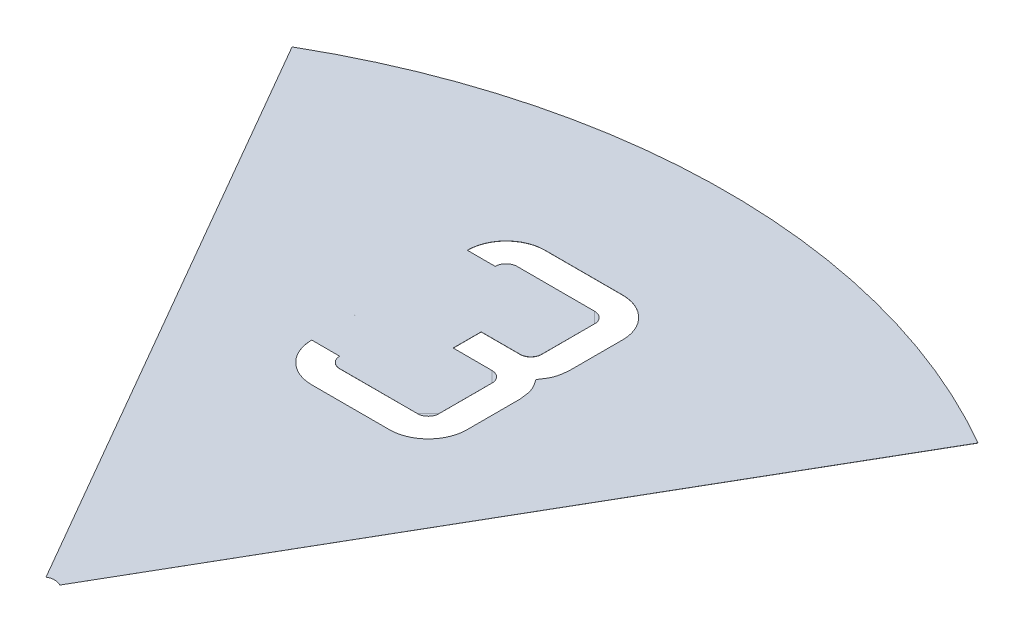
ISO-10303-21;
HEADER;
FILE_DESCRIPTION(('STEP AP214'),'2;1');
FILE_NAME('part.step','',(''),(''),'','','');
FILE_SCHEMA(('AUTOMOTIVE_DESIGN { 1 0 10303 214 1 1 1 1 }'));
ENDSEC;
DATA;
#1=APPLICATION_CONTEXT('core data for automotive mechanical design processes');
#2=APPLICATION_PROTOCOL_DEFINITION('international standard','automotive_design',2000,#1);
#3=PRODUCT_CONTEXT('',#1,'mechanical');
#4=PRODUCT('Part','Part','',(#3));
#5=PRODUCT_RELATED_PRODUCT_CATEGORY('part','',(#4));
#6=PRODUCT_DEFINITION_FORMATION('','',#4);
#7=PRODUCT_DEFINITION_CONTEXT('part definition',#1,'design');
#8=PRODUCT_DEFINITION('design','',#6,#7);
#9=PRODUCT_DEFINITION_SHAPE('','',#8);
#10=(LENGTH_UNIT() NAMED_UNIT(*) SI_UNIT(.MILLI.,.METRE.));
#11=(NAMED_UNIT(*) PLANE_ANGLE_UNIT() SI_UNIT($,.RADIAN.));
#12=(NAMED_UNIT(*) SI_UNIT($,.STERADIAN.) SOLID_ANGLE_UNIT());
#13=UNCERTAINTY_MEASURE_WITH_UNIT(LENGTH_MEASURE(1.E-05),#10,'distance_accuracy_value','');
#14=(GEOMETRIC_REPRESENTATION_CONTEXT(3) GLOBAL_UNCERTAINTY_ASSIGNED_CONTEXT((#13)) GLOBAL_UNIT_ASSIGNED_CONTEXT((#10,
#11,#12)) REPRESENTATION_CONTEXT('',''));
#15=CARTESIAN_POINT('',(0.,0.,0.));
#16=DIRECTION('',(0.,0.,1.));
#17=DIRECTION('',(1.,0.,0.));
#18=AXIS2_PLACEMENT_3D('',#15,#16,#17);
#19=CARTESIAN_POINT('',(-12.9159476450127,-10.5069257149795,13.9606136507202));
#20=DIRECTION('',(0.,1.,0.));
#21=DIRECTION('',(0.,0.,1.));
#22=AXIS2_PLACEMENT_3D('',#19,#20,#21);
#23=PLANE('',#22);
#24=CARTESIAN_POINT('',(-15.8664689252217,-10.5069257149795,-11.5576039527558));
#25=DIRECTION('',(0.,-1.,0.));
#26=DIRECTION('',(0.,0.,1.));
#27=AXIS2_PLACEMENT_3D('',#24,#25,#26);
#28=CIRCLE('',#27,0.7905);
#29=CARTESIAN_POINT('',(-15.8664689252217,-10.5069257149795,-10.7671039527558));
#30=VERTEX_POINT('',#29);
#31=CARTESIAN_POINT('',(-16.6569689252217,-10.5119257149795,-11.5576039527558));
#32=VERTEX_POINT('',#31);
#33=EDGE_CURVE('E498',#30,#32,#28,.T.);
#34=ORIENTED_EDGE('',*,*,#33,.F.);
#35=DIRECTION('',(-1.,0.,0.));
#36=VECTOR('',#35,1.);
#37=CARTESIAN_POINT('',(-15.8664689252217,-10.5069257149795,-10.7671039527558));
#38=LINE('',#37,#36);
#39=CARTESIAN_POINT('',(-10.2054689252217,-10.5119257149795,-10.7671039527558));
#40=VERTEX_POINT('',#39);
#41=EDGE_CURVE('E493',#40,#30,#38,.T.);
#42=ORIENTED_EDGE('',*,*,#41,.F.);
#43=CARTESIAN_POINT('',(-9.41496892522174,-10.5169257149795,-11.5576039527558));
#44=CARTESIAN_POINT('',(-9.41630499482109,-10.5169257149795,-11.2266682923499));
#45=CARTESIAN_POINT('',(-9.64650101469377,-10.5169257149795,-10.9986360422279));
#46=CARTESIAN_POINT('',(-9.87889912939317,-10.5169257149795,-10.7684223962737));
#47=CARTESIAN_POINT('',(-10.2054689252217,-10.5169257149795,-10.7671039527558));
#48=B_SPLINE_CURVE_WITH_KNOTS('',2,(#43,#44,#45,#46,#47),.UNSPECIFIED.,.F.,.F.,(3,2,3),(0.,0.5,
1.),.UNSPECIFIED.);
#49=CARTESIAN_POINT('',(-9.41496892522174,-10.5119257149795,-11.5576039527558));
#50=VERTEX_POINT('',#49);
#51=EDGE_CURVE('E340',#50,#40,#48,.T.);
#52=ORIENTED_EDGE('',*,*,#51,.F.);
#53=DIRECTION('',(0.,0.,1.));
#54=VECTOR('',#53,1.);
#55=CARTESIAN_POINT('',(-9.41496892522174,-10.5069257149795,-11.5576039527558));
#56=LINE('',#55,#54);
#57=CARTESIAN_POINT('',(-9.41496892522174,-10.5119257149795,-15.4166039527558));
#58=VERTEX_POINT('',#57);
#59=EDGE_CURVE('E491',#58,#50,#56,.T.);
#60=ORIENTED_EDGE('',*,*,#59,.F.);
#61=CARTESIAN_POINT('',(-10.2054689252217,-10.5169257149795,-16.2071039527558));
#62=CARTESIAN_POINT('',(-9.87453326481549,-10.5169257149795,-16.2057678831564));
#63=CARTESIAN_POINT('',(-9.64650101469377,-10.5169257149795,-15.9755718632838));
#64=CARTESIAN_POINT('',(-9.41628736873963,-10.5169257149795,-15.7431737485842));
#65=CARTESIAN_POINT('',(-9.41496892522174,-10.5169257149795,-15.4166039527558));
#66=B_SPLINE_CURVE_WITH_KNOTS('',2,(#61,#62,#63,#64,#65),.UNSPECIFIED.,.F.,.F.,(3,2,3),(0.,0.5,
1.),.UNSPECIFIED.);
#67=CARTESIAN_POINT('',(-10.2054689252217,-10.5119257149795,-16.2071039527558));
#68=VERTEX_POINT('',#67);
#69=EDGE_CURVE('E352',#68,#58,#66,.T.);
#70=ORIENTED_EDGE('',*,*,#69,.F.);
#71=DIRECTION('',(1.,0.,0.));
#72=VECTOR('',#71,1.);
#73=CARTESIAN_POINT('',(-13.0359689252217,-10.5069257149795,-16.2071039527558));
#74=LINE('',#73,#72);
#75=CARTESIAN_POINT('',(-13.0359689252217,-10.5069257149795,-16.2071039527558));
#76=VERTEX_POINT('',#75);
#77=EDGE_CURVE('E421',#76,#68,#74,.T.);
#78=ORIENTED_EDGE('',*,*,#77,.F.);
#79=DIRECTION('',(0.,0.,1.));
#80=VECTOR('',#79,1.);
#81=CARTESIAN_POINT('',(-13.0359689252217,-10.5069257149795,-18.2471039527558));
#82=LINE('',#81,#80);
#83=CARTESIAN_POINT('',(-13.0359689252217,-10.5069257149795,-18.2471039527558));
#84=VERTEX_POINT('',#83);
#85=EDGE_CURVE('E474',#84,#76,#82,.T.);
#86=ORIENTED_EDGE('',*,*,#85,.F.);
#87=DIRECTION('',(-1.,0.,0.));
#88=VECTOR('',#87,1.);
#89=CARTESIAN_POINT('',(-10.2054689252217,-10.5069257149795,-18.2471039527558));
#90=LINE('',#89,#88);
#91=CARTESIAN_POINT('',(-10.2054689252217,-10.5069257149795,-18.2471039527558));
#92=VERTEX_POINT('',#91);
#93=EDGE_CURVE('E179',#92,#84,#90,.T.);
#94=ORIENTED_EDGE('',*,*,#93,.F.);
#95=CARTESIAN_POINT('',(-10.2054689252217,-10.5069257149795,-19.0376039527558));
#96=DIRECTION('',(0.,-1.,0.));
#97=DIRECTION('',(0.,0.,1.));
#98=AXIS2_PLACEMENT_3D('',#95,#96,#97);
#99=CIRCLE('',#98,0.7905);
#100=CARTESIAN_POINT('',(-9.41496892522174,-10.5069257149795,-19.0376039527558));
#101=VERTEX_POINT('',#100);
#102=EDGE_CURVE('E176',#101,#92,#99,.T.);
#103=ORIENTED_EDGE('',*,*,#102,.F.);
#104=DIRECTION('',(0.,0.,1.));
#105=VECTOR('',#104,1.);
#106=CARTESIAN_POINT('',(-9.41496892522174,-10.5069257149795,-19.0376039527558));
#107=LINE('',#106,#105);
#108=CARTESIAN_POINT('',(-9.41496892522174,-10.5119257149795,-22.8966039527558));
#109=VERTEX_POINT('',#108);
#110=EDGE_CURVE('E168',#109,#101,#107,.T.);
#111=ORIENTED_EDGE('',*,*,#110,.F.);
#112=CARTESIAN_POINT('',(-10.2054689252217,-10.5169257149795,-23.6871039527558));
#113=CARTESIAN_POINT('',(-9.87453326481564,-10.5169257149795,-23.6857678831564));
#114=CARTESIAN_POINT('',(-9.64650101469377,-10.5169257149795,-23.4555718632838));
#115=CARTESIAN_POINT('',(-9.41628736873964,-10.5169257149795,-23.2231737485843));
#116=CARTESIAN_POINT('',(-9.41496892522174,-10.5169257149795,-22.8966039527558));
#117=B_SPLINE_CURVE_WITH_KNOTS('',2,(#112,#113,#114,#115,#116),.UNSPECIFIED.,.F.,.F.,(3,2,3),
(0.,0.5,1.),.UNSPECIFIED.);
#118=CARTESIAN_POINT('',(-10.2054689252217,-10.5119257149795,-23.6871039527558));
#119=VERTEX_POINT('',#118);
#120=EDGE_CURVE('E173',#119,#109,#117,.T.);
#121=ORIENTED_EDGE('',*,*,#120,.F.);
#122=DIRECTION('',(1.,0.,0.));
#123=VECTOR('',#122,1.);
#124=CARTESIAN_POINT('',(-10.2054689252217,-10.5069257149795,-23.6871039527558));
#125=LINE('',#124,#123);
#126=CARTESIAN_POINT('',(-15.8664689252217,-10.5069257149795,-23.6871039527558));
#127=VERTEX_POINT('',#126);
#128=EDGE_CURVE('E570',#127,#119,#125,.T.);
#129=ORIENTED_EDGE('',*,*,#128,.F.);
#130=CARTESIAN_POINT('',(-15.8664689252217,-10.5069257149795,-22.8966039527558));
#131=DIRECTION('',(0.,-1.,0.));
#132=DIRECTION('',(0.,0.,1.));
#133=AXIS2_PLACEMENT_3D('',#130,#131,#132);
#134=CIRCLE('',#133,0.7905);
#135=CARTESIAN_POINT('',(-16.6569689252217,-10.5119257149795,-22.8966039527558));
#136=VERTEX_POINT('',#135);
#137=EDGE_CURVE('E565',#136,#127,#134,.T.);
#138=ORIENTED_EDGE('',*,*,#137,.F.);
#139=CARTESIAN_POINT('',(-18.6969689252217,-10.5169257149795,-22.8966039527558));
#140=DIRECTION('',(1.,0.,0.));
#141=VECTOR('',#140,1.);
#142=LINE('',#139,#141);
#143=CARTESIAN_POINT('',(-18.6969689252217,-10.5119257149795,-22.8966039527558));
#144=VERTEX_POINT('',#143);
#145=EDGE_CURVE('E252',#144,#136,#142,.T.);
#146=ORIENTED_EDGE('',*,*,#145,.F.);
#147=CARTESIAN_POINT('',(-15.8664689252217,-10.5069257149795,-22.8966039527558));
#148=DIRECTION('',(0.,1.,0.));
#149=DIRECTION('',(0.,0.,1.));
#150=AXIS2_PLACEMENT_3D('',#147,#148,#149);
#151=CIRCLE('',#150,2.8305);
#152=CARTESIAN_POINT('',(-15.8664689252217,-10.5069257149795,-25.7271039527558));
#153=VERTEX_POINT('',#152);
#154=EDGE_CURVE('E511',#153,#144,#151,.T.);
#155=ORIENTED_EDGE('',*,*,#154,.F.);
#156=DIRECTION('',(-1.,0.,0.));
#157=VECTOR('',#156,1.);
#158=CARTESIAN_POINT('',(-10.2054689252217,-10.5069257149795,-25.7271039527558));
#159=LINE('',#158,#157);
#160=CARTESIAN_POINT('',(-10.2054689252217,-10.5069257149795,-25.7271039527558));
#161=VERTEX_POINT('',#160);
#162=EDGE_CURVE('E505',#161,#153,#159,.T.);
#163=ORIENTED_EDGE('',*,*,#162,.F.);
#164=CARTESIAN_POINT('',(-10.2054689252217,-10.5069257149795,-22.8966039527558));
#165=DIRECTION('',(0.,1.,0.));
#166=DIRECTION('',(0.,0.,1.));
#167=AXIS2_PLACEMENT_3D('',#164,#165,#166);
#168=CIRCLE('',#167,2.8305);
#169=CARTESIAN_POINT('',(-7.37496892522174,-10.5069257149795,-22.8966039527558));
#170=VERTEX_POINT('',#169);
#171=EDGE_CURVE('E515',#170,#161,#168,.T.);
#172=ORIENTED_EDGE('',*,*,#171,.F.);
#173=DIRECTION('',(0.,0.,-1.));
#174=VECTOR('',#173,1.);
#175=CARTESIAN_POINT('',(-7.37496892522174,-10.5069257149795,-19.0376039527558));
#176=LINE('',#175,#174);
#177=CARTESIAN_POINT('',(-7.37496892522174,-10.5069257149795,-19.0376039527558));
#178=VERTEX_POINT('',#177);
#179=EDGE_CURVE('E520',#178,#170,#176,.T.);
#180=ORIENTED_EDGE('',*,*,#179,.F.);
#181=CARTESIAN_POINT('',(-8.02973456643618,-10.5069257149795,-17.2271039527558));
#182=CARTESIAN_POINT('',(-7.84127551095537,-10.5069257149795,-17.5001638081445));
#183=CARTESIAN_POINT('',(-7.46435739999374,-10.5069257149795,-18.0462835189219));
#184=CARTESIAN_POINT('',(-7.40476508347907,-10.5069257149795,-18.7071638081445));
#185=CARTESIAN_POINT('',(-7.37496892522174,-10.5069257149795,-19.0376039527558));
#186=B_SPLINE_CURVE_WITH_KNOTS('',3,(#181,#182,#183,#184,#185),.UNSPECIFIED.,.F.,.F.,(4,1,4),
(0.,0.5,1.),.UNSPECIFIED.);
#187=CARTESIAN_POINT('',(-8.02973456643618,-10.5069257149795,-17.2271039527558));
#188=VERTEX_POINT('',#187);
#189=EDGE_CURVE('E525',#188,#178,#186,.T.);
#190=ORIENTED_EDGE('',*,*,#189,.F.);
#191=CARTESIAN_POINT('',(-7.37496892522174,-10.5069257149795,-15.4166039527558));
#192=CARTESIAN_POINT('',(-7.40476508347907,-10.5069257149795,-15.7470440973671));
#193=CARTESIAN_POINT('',(-7.46435739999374,-10.5069257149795,-16.4079243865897));
#194=CARTESIAN_POINT('',(-7.84127551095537,-10.5069257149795,-16.9540440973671));
#195=CARTESIAN_POINT('',(-8.02973456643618,-10.5069257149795,-17.2271039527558));
#196=B_SPLINE_CURVE_WITH_KNOTS('',3,(#191,#192,#193,#194,#195),.UNSPECIFIED.,.F.,.F.,(4,1,4),
(0.,0.5,1.),.UNSPECIFIED.);
#197=CARTESIAN_POINT('',(-7.37496892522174,-10.5069257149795,-15.4166039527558));
#198=VERTEX_POINT('',#197);
#199=EDGE_CURVE('E532',#198,#188,#196,.T.);
#200=ORIENTED_EDGE('',*,*,#199,.F.);
#201=DIRECTION('',(0.,0.,-1.));
#202=VECTOR('',#201,1.);
#203=CARTESIAN_POINT('',(-7.37496892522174,-10.5069257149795,-11.5576039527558));
#204=LINE('',#203,#202);
#205=CARTESIAN_POINT('',(-7.37496892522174,-10.5069257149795,-11.5576039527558));
#206=VERTEX_POINT('',#205);
#207=EDGE_CURVE('E542',#206,#198,#204,.T.);
#208=ORIENTED_EDGE('',*,*,#207,.F.);
#209=CARTESIAN_POINT('',(-10.2054689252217,-10.5069257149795,-11.5576039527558));
#210=DIRECTION('',(0.,1.,0.));
#211=DIRECTION('',(0.,0.,1.));
#212=AXIS2_PLACEMENT_3D('',#209,#210,#211);
#213=CIRCLE('',#212,2.8305);
#214=CARTESIAN_POINT('',(-10.2054689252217,-10.5069257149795,-8.72710395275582));
#215=VERTEX_POINT('',#214);
#216=EDGE_CURVE('E550',#215,#206,#213,.T.);
#217=ORIENTED_EDGE('',*,*,#216,.F.);
#218=DIRECTION('',(1.,0.,0.));
#219=VECTOR('',#218,1.);
#220=CARTESIAN_POINT('',(-15.8664689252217,-10.5069257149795,-8.72710395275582));
#221=LINE('',#220,#219);
#222=CARTESIAN_POINT('',(-15.8664689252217,-10.5069257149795,-8.72710395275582));
#223=VERTEX_POINT('',#222);
#224=EDGE_CURVE('E555',#223,#215,#221,.T.);
#225=ORIENTED_EDGE('',*,*,#224,.F.);
#226=CARTESIAN_POINT('',(-15.8664689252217,-10.5069257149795,-11.5576039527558));
#227=DIRECTION('',(0.,1.,0.));
#228=DIRECTION('',(0.,0.,1.));
#229=AXIS2_PLACEMENT_3D('',#226,#227,#228);
#230=CIRCLE('',#229,2.8305);
#231=CARTESIAN_POINT('',(-18.6969689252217,-10.5119257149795,-11.5576039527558));
#232=VERTEX_POINT('',#231);
#233=EDGE_CURVE('E552',#232,#223,#230,.T.);
#234=ORIENTED_EDGE('',*,*,#233,.F.);
#235=CARTESIAN_POINT('',(-16.6569689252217,-10.5169257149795,-11.5576039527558));
#236=DIRECTION('',(-1.,0.,0.));
#237=VECTOR('',#236,1.);
#238=LINE('',#235,#237);
#239=EDGE_CURVE('E812',#32,#232,#238,.T.);
#240=ORIENTED_EDGE('',*,*,#239,.F.);
#241=EDGE_LOOP('',(#34,#42,#52,#60,#70,#78,#86,#94,#103,#111,#121,#129,#138,#146,#155,#163,#172,
#180,#190,#200,#208,#217,#225,#234,#240));
#242=FACE_BOUND('',#241,.T.);
#243=CARTESIAN_POINT('',(-13.4159476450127,-10.5069257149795,13.0945882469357));
#244=CARTESIAN_POINT('',(-13.180949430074,-10.5069257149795,12.9598041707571));
#245=CARTESIAN_POINT('',(-12.9159476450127,-10.5069257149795,12.9606136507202));
#246=CARTESIAN_POINT('',(-12.6481080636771,-10.5069257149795,12.9614317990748));
#247=CARTESIAN_POINT('',(-12.4159476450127,-10.5069257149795,13.0945882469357));
#248=B_SPLINE_CURVE_WITH_KNOTS('',2,(#243,#244,#245,#246,#247),.UNSPECIFIED.,.F.,.F.,(3,2,3),
(0.,0.5,1.),.UNSPECIFIED.);
#249=CARTESIAN_POINT('',(-13.4159476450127,-10.5119257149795,13.0945882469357));
#250=VERTEX_POINT('',#249);
#251=CARTESIAN_POINT('',(-12.4159476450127,-10.5119257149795,13.0945882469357));
#252=VERTEX_POINT('',#251);
#253=EDGE_CURVE('E26',#250,#252,#248,.T.);
#254=ORIENTED_EDGE('',*,*,#253,.T.);
#255=DIRECTION('',(0.499999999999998,0.,-0.86602540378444));
#256=VECTOR('',#255,1.);
#257=CARTESIAN_POINT('',(-12.4159476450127,-10.5069257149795,13.0945882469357));
#258=LINE('',#257,#256);
#259=CARTESIAN_POINT('',(12.0840523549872,-10.5069257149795,-29.3406565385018));
#260=VERTEX_POINT('',#259);
#261=EDGE_CURVE('E197',#252,#260,#258,.T.);
#262=ORIENTED_EDGE('',*,*,#261,.T.);
#263=CARTESIAN_POINT('',(-12.9159476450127,-10.5069257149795,13.9606136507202));
#264=DIRECTION('',(0.,1.,0.));
#265=DIRECTION('',(0.,0.,1.));
#266=AXIS2_PLACEMENT_3D('',#263,#264,#265);
#267=CIRCLE('',#266,50.);
#268=CARTESIAN_POINT('',(-37.9159476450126,-10.5069257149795,-29.3406565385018));
#269=VERTEX_POINT('',#268);
#270=EDGE_CURVE('E416',#260,#269,#267,.T.);
#271=ORIENTED_EDGE('',*,*,#270,.T.);
#272=DIRECTION('',(0.499999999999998,0.,0.86602540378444));
#273=VECTOR('',#272,1.);
#274=CARTESIAN_POINT('',(-13.4159476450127,-10.5069257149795,13.0945882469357));
#275=LINE('',#274,#273);
#276=EDGE_CURVE('E415',#269,#250,#275,.T.);
#277=ORIENTED_EDGE('',*,*,#276,.T.);
#278=EDGE_LOOP('',(#254,#262,#271,#277));
#279=FACE_BOUND('',#278,.T.);
#280=ADVANCED_FACE('F14',(#242,#279),#23,.T.);
#281=CARTESIAN_POINT('',(-15.8664689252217,-20.5069257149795,-22.8966039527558));
#282=DIRECTION('',(0.,1.,0.));
#283=DIRECTION('',(0.,0.,1.));
#284=AXIS2_PLACEMENT_3D('',#281,#282,#283);
#285=CYLINDRICAL_SURFACE('',#284,0.7905);
#286=ORIENTED_EDGE('',*,*,#137,.T.);
#287=DIRECTION('',(0.,1.,0.));
#288=VECTOR('',#287,1.);
#289=CARTESIAN_POINT('',(-15.8664689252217,-20.5069257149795,-23.6871039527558));
#290=LINE('',#289,#288);
#291=CARTESIAN_POINT('',(-15.8664689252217,-10.5169257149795,-23.6871039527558));
#292=VERTEX_POINT('',#291);
#293=EDGE_CURVE('E567',#292,#127,#290,.T.);
#294=ORIENTED_EDGE('',*,*,#293,.F.);
#295=CARTESIAN_POINT('',(-15.8664689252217,-10.5169257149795,-22.8966039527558));
#296=DIRECTION('',(0.,1.,0.));
#297=DIRECTION('',(0.,0.,-1.));
#298=AXIS2_PLACEMENT_3D('',#295,#296,#297);
#299=CIRCLE('',#298,0.7905);
#300=EDGE_CURVE('E261',#292,#136,#299,.T.);
#301=ORIENTED_EDGE('',*,*,#300,.T.);
#302=EDGE_LOOP('',(#286,#294,#301));
#303=FACE_BOUND('',#302,.T.);
#304=ADVANCED_FACE('F211',(#303),#285,.T.);
#305=CARTESIAN_POINT('',(-10.2054689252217,-20.5069257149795,-23.6871039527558));
#306=DIRECTION('',(0.,0.,1.));
#307=DIRECTION('',(1.,0.,0.));
#308=AXIS2_PLACEMENT_3D('',#305,#306,#307);
#309=PLANE('',#308);
#310=ORIENTED_EDGE('',*,*,#293,.T.);
#311=ORIENTED_EDGE('',*,*,#128,.T.);
#312=CARTESIAN_POINT('',(-15.8664689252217,-10.5169257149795,-23.6871039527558));
#313=CARTESIAN_POINT('',(-10.2054689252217,-10.5169257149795,-23.6871039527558));
#314=B_SPLINE_CURVE_WITH_KNOTS('',1,(#312,#313),.UNSPECIFIED.,.F.,.F.,(2,2),(0.,1.),.UNSPECIFIED.);
#315=EDGE_CURVE('E196',#292,#119,#314,.T.);
#316=ORIENTED_EDGE('',*,*,#315,.F.);
#317=EDGE_LOOP('',(#310,#311,#316));
#318=FACE_BOUND('',#317,.T.);
#319=ADVANCED_FACE('F895',(#318),#309,.F.);
#320=CARTESIAN_POINT('',(-15.8664689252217,-20.5069257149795,-8.72710395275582));
#321=DIRECTION('',(0.,0.,1.));
#322=DIRECTION('',(1.,0.,0.));
#323=AXIS2_PLACEMENT_3D('',#320,#321,#322);
#324=PLANE('',#323);
#325=DIRECTION('',(0.,1.,0.));
#326=VECTOR('',#325,1.);
#327=CARTESIAN_POINT('',(-15.8664689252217,-20.5069257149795,-8.72710395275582));
#328=LINE('',#327,#326);
#329=CARTESIAN_POINT('',(-15.8664689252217,-10.5169257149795,-8.72710395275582));
#330=VERTEX_POINT('',#329);
#331=EDGE_CURVE('E558',#330,#223,#328,.T.);
#332=ORIENTED_EDGE('',*,*,#331,.T.);
#333=ORIENTED_EDGE('',*,*,#224,.T.);
#334=DIRECTION('',(0.,1.,0.));
#335=VECTOR('',#334,1.);
#336=CARTESIAN_POINT('',(-10.2054689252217,-20.5069257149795,-8.72710395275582));
#337=LINE('',#336,#335);
#338=CARTESIAN_POINT('',(-10.2054689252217,-10.5169257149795,-8.72710395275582));
#339=VERTEX_POINT('',#338);
#340=EDGE_CURVE('E557',#339,#215,#337,.T.);
#341=ORIENTED_EDGE('',*,*,#340,.F.);
#342=CARTESIAN_POINT('',(-15.8664689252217,-10.5169257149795,-8.72710395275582));
#343=CARTESIAN_POINT('',(-10.2054689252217,-10.5169257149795,-8.72710395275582));
#344=B_SPLINE_CURVE_WITH_KNOTS('',1,(#342,#343),.UNSPECIFIED.,.F.,.F.,(2,2),(0.,1.),.UNSPECIFIED.);
#345=EDGE_CURVE('E323',#330,#339,#344,.T.);
#346=ORIENTED_EDGE('',*,*,#345,.F.);
#347=EDGE_LOOP('',(#332,#333,#341,#346));
#348=FACE_BOUND('',#347,.T.);
#349=ADVANCED_FACE('F673',(#348),#324,.F.);
#350=CARTESIAN_POINT('',(-15.8664689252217,-20.5069257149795,-11.5576039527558));
#351=DIRECTION('',(0.,1.,0.));
#352=DIRECTION('',(0.,0.,1.));
#353=AXIS2_PLACEMENT_3D('',#350,#351,#352);
#354=CYLINDRICAL_SURFACE('',#353,2.8305);
#355=ORIENTED_EDGE('',*,*,#233,.T.);
#356=ORIENTED_EDGE('',*,*,#331,.F.);
#357=CARTESIAN_POINT('',(-18.6969689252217,-10.5169257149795,-11.5576039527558));
#358=CARTESIAN_POINT('',(-18.6969208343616,-10.5169257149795,-11.2973935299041));
#359=CARTESIAN_POINT('',(-18.6497147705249,-10.5169257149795,-11.0425575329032));
#360=CARTESIAN_POINT('',(-18.5994583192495,-10.5169257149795,-10.7712544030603));
#361=CARTESIAN_POINT('',(-18.498234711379,-10.5169257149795,-10.5157118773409));
#362=CARTESIAN_POINT('',(-18.3923631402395,-10.5169257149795,-10.2484354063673));
#363=CARTESIAN_POINT('',(-18.2355847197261,-10.5169257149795,-10.0087267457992));
#364=CARTESIAN_POINT('',(-18.0748664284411,-10.5169257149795,-9.76299416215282));
#365=CARTESIAN_POINT('',(-17.8679346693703,-10.5169257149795,-9.5561382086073));
#366=CARTESIAN_POINT('',(-17.6602733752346,-10.5169257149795,-9.34855298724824));
#367=CARTESIAN_POINT('',(-17.4153461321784,-10.5169257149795,-9.18848815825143));
#368=CARTESIAN_POINT('',(-17.174696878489,-10.5169257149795,-9.03121908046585));
#369=CARTESIAN_POINT('',(-16.9083610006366,-10.5169257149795,-8.92583816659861));
#370=CARTESIAN_POINT('',(-16.651795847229,-10.5169257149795,-8.82432322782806));
#371=CARTESIAN_POINT('',(-16.3815153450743,-10.5169257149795,-8.7743581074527));
#372=CARTESIAN_POINT('',(-16.1261591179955,-10.5169257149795,-8.72715194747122));
#373=CARTESIAN_POINT('',(-15.8664689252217,-10.5169257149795,-8.72710395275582));
#374=B_SPLINE_CURVE_WITH_KNOTS('',2,(#357,#358,#359,#360,#361,#362,#363,#364,#365,#366,#367,
#368,#369,#370,#371,#372,#373),.UNSPECIFIED.,.F.,.F.,(3,2,2,2,2,2,2,2,3),(0.,0.125,0.25,0.375,
0.5,0.625,0.75,0.875,1.),.UNSPECIFIED.);
#375=EDGE_CURVE('E329',#232,#330,#374,.T.);
#376=ORIENTED_EDGE('',*,*,#375,.F.);
#377=EDGE_LOOP('',(#355,#356,#376));
#378=FACE_BOUND('',#377,.T.);
#379=ADVANCED_FACE('F662',(#378),#354,.F.);
#380=CARTESIAN_POINT('',(-10.2054689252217,-20.5069257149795,-11.5576039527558));
#381=DIRECTION('',(0.,1.,0.));
#382=DIRECTION('',(0.,0.,1.));
#383=AXIS2_PLACEMENT_3D('',#380,#381,#382);
#384=CYLINDRICAL_SURFACE('',#383,2.8305);
#385=ORIENTED_EDGE('',*,*,#340,.T.);
#386=ORIENTED_EDGE('',*,*,#216,.T.);
#387=DIRECTION('',(0.,1.,0.));
#388=VECTOR('',#387,1.);
#389=CARTESIAN_POINT('',(-7.37496892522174,-20.5069257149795,-11.5576039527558));
#390=LINE('',#389,#388);
#391=CARTESIAN_POINT('',(-7.37496892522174,-10.5169257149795,-11.5576039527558));
#392=VERTEX_POINT('',#391);
#393=EDGE_CURVE('E547',#392,#206,#390,.T.);
#394=ORIENTED_EDGE('',*,*,#393,.F.);
#395=CARTESIAN_POINT('',(-10.2054689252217,-10.5169257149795,-8.72710395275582));
#396=CARTESIAN_POINT('',(-9.94525850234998,-10.5169257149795,-8.72715204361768));
#397=CARTESIAN_POINT('',(-9.69042250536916,-10.5169257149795,-8.7743581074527));
#398=CARTESIAN_POINT('',(-9.41911937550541,-10.5169257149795,-8.824614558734));
#399=CARTESIAN_POINT('',(-9.16357684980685,-10.5169257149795,-8.92583816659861));
#400=CARTESIAN_POINT('',(-8.8963003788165,-10.5169257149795,-9.03170973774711));
#401=CARTESIAN_POINT('',(-8.65659171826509,-10.5169257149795,-9.18848815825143));
#402=CARTESIAN_POINT('',(-8.41085913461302,-10.5169257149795,-9.34920644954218));
#403=CARTESIAN_POINT('',(-8.20400318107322,-10.5169257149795,-9.5561382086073));
#404=CARTESIAN_POINT('',(-7.99641795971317,-10.5169257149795,-9.76379950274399));
#405=CARTESIAN_POINT('',(-7.83635313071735,-10.5169257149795,-10.0087267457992));
#406=CARTESIAN_POINT('',(-7.67908405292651,-10.5169257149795,-10.2493759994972));
#407=CARTESIAN_POINT('',(-7.57370313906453,-10.5169257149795,-10.5157118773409));
#408=CARTESIAN_POINT('',(-7.47218820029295,-10.5169257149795,-10.7722770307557));
#409=CARTESIAN_POINT('',(-7.42222307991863,-10.5169257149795,-11.0425575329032));
#410=CARTESIAN_POINT('',(-7.37501691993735,-10.5169257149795,-11.2979137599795));
#411=CARTESIAN_POINT('',(-7.37496892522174,-10.5169257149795,-11.5576039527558));
#412=B_SPLINE_CURVE_WITH_KNOTS('',2,(#395,#396,#397,#398,#399,#400,#401,#402,#403,#404,#405,
#406,#407,#408,#409,#410,#411),.UNSPECIFIED.,.F.,.F.,(3,2,2,2,2,2,2,2,3),(0.,0.125,0.25,0.375,
0.5,0.625,0.75,0.875,1.),.UNSPECIFIED.);
#413=EDGE_CURVE('E318',#339,#392,#412,.T.);
#414=ORIENTED_EDGE('',*,*,#413,.F.);
#415=EDGE_LOOP('',(#385,#386,#394,#414));
#416=FACE_BOUND('',#415,.T.);
#417=ADVANCED_FACE('F672',(#416),#384,.F.);
#418=CARTESIAN_POINT('',(-7.37496892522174,-20.5069257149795,-11.5576039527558));
#419=DIRECTION('',(1.,0.,0.));
#420=DIRECTION('',(0.,0.,-1.));
#421=AXIS2_PLACEMENT_3D('',#418,#419,#420);
#422=PLANE('',#421);
#423=ORIENTED_EDGE('',*,*,#393,.T.);
#424=ORIENTED_EDGE('',*,*,#207,.T.);
#425=DIRECTION('',(0.,1.,0.));
#426=VECTOR('',#425,1.);
#427=CARTESIAN_POINT('',(-7.37496892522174,-20.5069257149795,-15.4166039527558));
#428=LINE('',#427,#426);
#429=CARTESIAN_POINT('',(-7.37496892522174,-10.5169257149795,-15.4166034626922));
#430=VERTEX_POINT('',#429);
#431=EDGE_CURVE('E537',#430,#198,#428,.T.);
#432=ORIENTED_EDGE('',*,*,#431,.F.);
#433=CARTESIAN_POINT('',(-7.37496892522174,-10.5169257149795,-11.5576039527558));
#434=CARTESIAN_POINT('',(-7.37496892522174,-10.5169257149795,-15.4166039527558));
#435=B_SPLINE_CURVE_WITH_KNOTS('',1,(#433,#434),.UNSPECIFIED.,.F.,.F.,(2,2),(0.,1.),.UNSPECIFIED.);
#436=EDGE_CURVE('E308',#392,#430,#435,.T.);
#437=ORIENTED_EDGE('',*,*,#436,.F.);
#438=EDGE_LOOP('',(#423,#424,#432,#437));
#439=FACE_BOUND('',#438,.T.);
#440=ADVANCED_FACE('F677',(#439),#422,.F.);
#441=CARTESIAN_POINT('',(-7.37496892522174,-20.5069257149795,-15.4166039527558));
#442=CARTESIAN_POINT('',(-7.40476508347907,-20.5069257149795,-15.7470440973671));
#443=CARTESIAN_POINT('',(-7.46435739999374,-20.5069257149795,-16.4079243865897));
#444=CARTESIAN_POINT('',(-7.84127551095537,-20.5069257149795,-16.9540440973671));
#445=CARTESIAN_POINT('',(-8.02973456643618,-20.5069257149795,-17.2271039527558));
#446=B_SPLINE_CURVE_WITH_KNOTS('',3,(#441,#442,#443,#444,#445),.UNSPECIFIED.,.F.,.F.,(4,1,4),
(0.,0.5,1.),.UNSPECIFIED.);
#447=DIRECTION('',(0.,1.,0.));
#448=VECTOR('',#447,1.);
#449=SURFACE_OF_LINEAR_EXTRUSION('',#446,#448);
#450=ORIENTED_EDGE('',*,*,#431,.T.);
#451=ORIENTED_EDGE('',*,*,#199,.T.);
#452=DIRECTION('',(0.,1.,0.));
#453=VECTOR('',#452,1.);
#454=CARTESIAN_POINT('',(-8.02973456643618,-20.5069257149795,-17.2271039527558));
#455=LINE('',#454,#453);
#456=CARTESIAN_POINT('',(-8.02973449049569,-10.5169257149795,-17.227103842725));
#457=VERTEX_POINT('',#456);
#458=EDGE_CURVE('E527',#457,#188,#455,.T.);
#459=ORIENTED_EDGE('',*,*,#458,.F.);
#460=CARTESIAN_POINT('',(-7.37496892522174,-10.5169257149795,-15.4166039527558));
#461=CARTESIAN_POINT('',(-7.40476508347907,-10.5169257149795,-15.7470440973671));
#462=CARTESIAN_POINT('',(-7.46435739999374,-10.5169257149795,-16.4079243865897));
#463=CARTESIAN_POINT('',(-7.84127551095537,-10.5169257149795,-16.9540440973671));
#464=CARTESIAN_POINT('',(-8.02973456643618,-10.5169257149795,-17.2271039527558));
#465=B_SPLINE_CURVE_WITH_KNOTS('',3,(#460,#461,#462,#463,#464),.UNSPECIFIED.,.F.,.F.,(4,1,4),
(0.,0.5,1.),.UNSPECIFIED.);
#466=EDGE_CURVE('E302',#430,#457,#465,.T.);
#467=ORIENTED_EDGE('',*,*,#466,.F.);
#468=EDGE_LOOP('',(#450,#451,#459,#467));
#469=FACE_BOUND('',#468,.T.);
#470=ADVANCED_FACE('F733',(#469),#449,.F.);
#471=CARTESIAN_POINT('',(-8.02973456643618,-20.5069257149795,-17.2271039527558));
#472=CARTESIAN_POINT('',(-7.84127551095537,-20.5069257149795,-17.5001638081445));
#473=CARTESIAN_POINT('',(-7.46435739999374,-20.5069257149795,-18.0462835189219));
#474=CARTESIAN_POINT('',(-7.40476508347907,-20.5069257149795,-18.7071638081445));
#475=CARTESIAN_POINT('',(-7.37496892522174,-20.5069257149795,-19.0376039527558));
#476=B_SPLINE_CURVE_WITH_KNOTS('',3,(#471,#472,#473,#474,#475),.UNSPECIFIED.,.F.,.F.,(4,1,4),
(0.,0.5,1.),.UNSPECIFIED.);
#477=DIRECTION('',(0.,1.,0.));
#478=VECTOR('',#477,1.);
#479=SURFACE_OF_LINEAR_EXTRUSION('',#476,#478);
#480=ORIENTED_EDGE('',*,*,#458,.T.);
#481=ORIENTED_EDGE('',*,*,#189,.T.);
#482=DIRECTION('',(0.,1.,0.));
#483=VECTOR('',#482,1.);
#484=CARTESIAN_POINT('',(-7.37496892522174,-20.5069257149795,-19.0376039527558));
#485=LINE('',#484,#483);
#486=CARTESIAN_POINT('',(-7.37496905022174,-10.5169257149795,-19.0376025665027));
#487=VERTEX_POINT('',#486);
#488=EDGE_CURVE('E522',#487,#178,#485,.T.);
#489=ORIENTED_EDGE('',*,*,#488,.F.);
#490=CARTESIAN_POINT('',(-7.37496892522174,-10.5169257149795,-19.0376039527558));
#491=CARTESIAN_POINT('',(-7.40476508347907,-10.5169257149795,-18.7071638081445));
#492=CARTESIAN_POINT('',(-7.46435739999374,-10.5169257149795,-18.0462835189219));
#493=CARTESIAN_POINT('',(-7.84127551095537,-10.5169257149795,-17.5001638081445));
#494=CARTESIAN_POINT('',(-8.02973456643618,-10.5169257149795,-17.2271039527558));
#495=B_SPLINE_CURVE_WITH_KNOTS('',3,(#490,#491,#492,#493,#494),.UNSPECIFIED.,.F.,.F.,(4,1,4),
(0.,0.5,1.),.UNSPECIFIED.);
#496=EDGE_CURVE('E297',#457,#487,#495,.F.);
#497=ORIENTED_EDGE('',*,*,#496,.F.);
#498=EDGE_LOOP('',(#480,#481,#489,#497));
#499=FACE_BOUND('',#498,.T.);
#500=ADVANCED_FACE('F723',(#499),#479,.F.);
#501=CARTESIAN_POINT('',(-7.37496892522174,-20.5069257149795,-19.0376039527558));
#502=DIRECTION('',(1.,0.,0.));
#503=DIRECTION('',(0.,0.,-1.));
#504=AXIS2_PLACEMENT_3D('',#501,#502,#503);
#505=PLANE('',#504);
#506=ORIENTED_EDGE('',*,*,#488,.T.);
#507=ORIENTED_EDGE('',*,*,#179,.T.);
#508=DIRECTION('',(0.,1.,0.));
#509=VECTOR('',#508,1.);
#510=CARTESIAN_POINT('',(-7.37496892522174,-20.5069257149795,-22.8966039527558));
#511=LINE('',#510,#509);
#512=CARTESIAN_POINT('',(-7.37496892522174,-10.5169257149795,-22.8966039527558));
#513=VERTEX_POINT('',#512);
#514=EDGE_CURVE('E517',#513,#170,#511,.T.);
#515=ORIENTED_EDGE('',*,*,#514,.F.);
#516=CARTESIAN_POINT('',(-7.37496892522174,-10.5169257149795,-19.0376039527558));
#517=CARTESIAN_POINT('',(-7.37496892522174,-10.5169257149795,-22.8966039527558));
#518=B_SPLINE_CURVE_WITH_KNOTS('',1,(#516,#517),.UNSPECIFIED.,.F.,.F.,(2,2),(0.,1.),.UNSPECIFIED.);
#519=EDGE_CURVE('E291',#487,#513,#518,.T.);
#520=ORIENTED_EDGE('',*,*,#519,.F.);
#521=EDGE_LOOP('',(#506,#507,#515,#520));
#522=FACE_BOUND('',#521,.T.);
#523=ADVANCED_FACE('F732',(#522),#505,.F.);
#524=CARTESIAN_POINT('',(-10.2054689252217,-20.5069257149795,-22.8966039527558));
#525=DIRECTION('',(0.,1.,0.));
#526=DIRECTION('',(0.,0.,1.));
#527=AXIS2_PLACEMENT_3D('',#524,#525,#526);
#528=CYLINDRICAL_SURFACE('',#527,2.8305);
#529=ORIENTED_EDGE('',*,*,#514,.T.);
#530=ORIENTED_EDGE('',*,*,#171,.T.);
#531=DIRECTION('',(0.,1.,0.));
#532=VECTOR('',#531,1.);
#533=CARTESIAN_POINT('',(-10.2054689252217,-20.5069257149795,-25.7271039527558));
#534=LINE('',#533,#532);
#535=CARTESIAN_POINT('',(-10.2054689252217,-10.5169257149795,-25.7271039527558));
#536=VERTEX_POINT('',#535);
#537=EDGE_CURVE('E508',#536,#161,#534,.T.);
#538=ORIENTED_EDGE('',*,*,#537,.F.);
#539=CARTESIAN_POINT('',(-7.37496892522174,-10.5169257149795,-22.8966039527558));
#540=CARTESIAN_POINT('',(-7.37501701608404,-10.5169257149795,-23.1568143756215));
#541=CARTESIAN_POINT('',(-7.42222307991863,-10.5169257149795,-23.4116503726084));
#542=CARTESIAN_POINT('',(-7.47247953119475,-10.5169257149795,-23.6829535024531));
#543=CARTESIAN_POINT('',(-7.57370313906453,-10.5169257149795,-23.9384960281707));
#544=CARTESIAN_POINT('',(-7.6795747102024,-10.5169257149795,-24.2057724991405));
#545=CARTESIAN_POINT('',(-7.83635313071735,-10.5169257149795,-24.4454811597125));
#546=CARTESIAN_POINT('',(-7.99707142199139,-10.5169257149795,-24.6912137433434));
#547=CARTESIAN_POINT('',(-8.20400318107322,-10.5169257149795,-24.8980696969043));
#548=CARTESIAN_POINT('',(-8.41166447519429,-10.5169257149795,-25.1056549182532));
#549=CARTESIAN_POINT('',(-8.65659171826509,-10.5169257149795,-25.2657197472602));
#550=CARTESIAN_POINT('',(-8.89724097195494,-10.5169257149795,-25.4229888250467));
#551=CARTESIAN_POINT('',(-9.16357684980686,-10.5169257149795,-25.528369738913));
#552=CARTESIAN_POINT('',(-9.42014200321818,-10.5169257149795,-25.6298846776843));
#553=CARTESIAN_POINT('',(-9.69042250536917,-10.5169257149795,-25.6798497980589));
#554=CARTESIAN_POINT('',(-9.94577873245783,-10.5169257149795,-25.7270559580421));
#555=CARTESIAN_POINT('',(-10.2054689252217,-10.5169257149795,-25.7271039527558));
#556=B_SPLINE_CURVE_WITH_KNOTS('',2,(#539,#540,#541,#542,#543,#544,#545,#546,#547,#548,#549,
#550,#551,#552,#553,#554,#555),.UNSPECIFIED.,.F.,.F.,(3,2,2,2,2,2,2,2,3),(0.,0.125,0.25,0.375,
0.5,0.625,0.75,0.875,1.),.UNSPECIFIED.);
#557=EDGE_CURVE('E286',#513,#536,#556,.T.);
#558=ORIENTED_EDGE('',*,*,#557,.F.);
#559=EDGE_LOOP('',(#529,#530,#538,#558));
#560=FACE_BOUND('',#559,.T.);
#561=ADVANCED_FACE('F735',(#560),#528,.F.);
#562=CARTESIAN_POINT('',(-10.2054689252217,-20.5069257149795,-25.7271039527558));
#563=DIRECTION('',(0.,0.,-1.));
#564=DIRECTION('',(-1.,0.,0.));
#565=AXIS2_PLACEMENT_3D('',#562,#563,#564);
#566=PLANE('',#565);
#567=ORIENTED_EDGE('',*,*,#537,.T.);
#568=ORIENTED_EDGE('',*,*,#162,.T.);
#569=DIRECTION('',(0.,1.,0.));
#570=VECTOR('',#569,1.);
#571=CARTESIAN_POINT('',(-15.8664689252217,-20.5069257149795,-25.7271039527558));
#572=LINE('',#571,#570);
#573=CARTESIAN_POINT('',(-15.8664689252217,-10.5169257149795,-25.7271039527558));
#574=VERTEX_POINT('',#573);
#575=EDGE_CURVE('E507',#574,#153,#572,.T.);
#576=ORIENTED_EDGE('',*,*,#575,.F.);
#577=CARTESIAN_POINT('',(-10.2054689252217,-10.5169257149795,-25.7271039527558));
#578=CARTESIAN_POINT('',(-15.8664689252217,-10.5169257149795,-25.7271039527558));
#579=B_SPLINE_CURVE_WITH_KNOTS('',1,(#577,#578),.UNSPECIFIED.,.F.,.F.,(2,2),(0.,1.),.UNSPECIFIED.);
#580=EDGE_CURVE('E268',#536,#574,#579,.T.);
#581=ORIENTED_EDGE('',*,*,#580,.F.);
#582=EDGE_LOOP('',(#567,#568,#576,#581));
#583=FACE_BOUND('',#582,.T.);
#584=ADVANCED_FACE('F622',(#583),#566,.F.);
#585=CARTESIAN_POINT('',(-15.8664689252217,-20.5069257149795,-22.8966039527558));
#586=DIRECTION('',(0.,1.,0.));
#587=DIRECTION('',(0.,0.,1.));
#588=AXIS2_PLACEMENT_3D('',#585,#586,#587);
#589=CYLINDRICAL_SURFACE('',#588,2.8305);
#590=ORIENTED_EDGE('',*,*,#575,.T.);
#591=ORIENTED_EDGE('',*,*,#154,.T.);
#592=CARTESIAN_POINT('',(-15.8664689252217,-10.5169257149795,-25.7271039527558));
#593=CARTESIAN_POINT('',(-16.1266793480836,-10.5169257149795,-25.727055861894));
#594=CARTESIAN_POINT('',(-16.3815153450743,-10.5169257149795,-25.6798497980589));
#595=CARTESIAN_POINT('',(-16.6528184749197,-10.5169257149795,-25.629593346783));
#596=CARTESIAN_POINT('',(-16.9083610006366,-10.5169257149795,-25.528369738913));
#597=CARTESIAN_POINT('',(-17.1756374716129,-10.5169257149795,-25.4224981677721));
#598=CARTESIAN_POINT('',(-17.4153461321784,-10.5169257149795,-25.2657197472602));
#599=CARTESIAN_POINT('',(-17.6610787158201,-10.5169257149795,-25.1050014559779));
#600=CARTESIAN_POINT('',(-17.8679346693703,-10.5169257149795,-24.8980696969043));
#601=CARTESIAN_POINT('',(-18.0755198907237,-10.5169257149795,-24.6904084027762));
#602=CARTESIAN_POINT('',(-18.2355847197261,-10.5169257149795,-24.4454811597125));
#603=CARTESIAN_POINT('',(-18.3928537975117,-10.5169257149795,-24.204831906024));
#604=CARTESIAN_POINT('',(-18.498234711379,-10.5169257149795,-23.9384960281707));
#605=CARTESIAN_POINT('',(-18.5997496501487,-10.5169257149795,-23.6819308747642));
#606=CARTESIAN_POINT('',(-18.6497147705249,-10.5169257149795,-23.4116503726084));
#607=CARTESIAN_POINT('',(-18.6969209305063,-10.5169257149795,-23.1562941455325));
#608=CARTESIAN_POINT('',(-18.6969689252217,-10.5169257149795,-22.8966039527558));
#609=B_SPLINE_CURVE_WITH_KNOTS('',2,(#592,#593,#594,#595,#596,#597,#598,#599,#600,#601,#602,
#603,#604,#605,#606,#607,#608),.UNSPECIFIED.,.F.,.F.,(3,2,2,2,2,2,2,2,3),(0.,0.125,0.25,0.375,
0.5,0.625,0.75,0.875,1.),.UNSPECIFIED.);
#610=EDGE_CURVE('E265',#574,#144,#609,.T.);
#611=ORIENTED_EDGE('',*,*,#610,.F.);
#612=EDGE_LOOP('',(#590,#591,#611));
#613=FACE_BOUND('',#612,.T.);
#614=ADVANCED_FACE('F611',(#613),#589,.F.);
#615=CARTESIAN_POINT('',(-15.8664689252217,-20.5069257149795,-11.5576039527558));
#616=DIRECTION('',(0.,1.,0.));
#617=DIRECTION('',(0.,0.,1.));
#618=AXIS2_PLACEMENT_3D('',#615,#616,#617);
#619=CYLINDRICAL_SURFACE('',#618,0.7905);
#620=DIRECTION('',(0.,1.,0.));
#621=VECTOR('',#620,1.);
#622=CARTESIAN_POINT('',(-15.8664689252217,-20.5069257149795,-10.7671039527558));
#623=LINE('',#622,#621);
#624=CARTESIAN_POINT('',(-15.8664689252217,-10.5169257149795,-10.7671039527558));
#625=VERTEX_POINT('',#624);
#626=EDGE_CURVE('E502',#625,#30,#623,.T.);
#627=ORIENTED_EDGE('',*,*,#626,.T.);
#628=ORIENTED_EDGE('',*,*,#33,.T.);
#629=CARTESIAN_POINT('',(-15.8664689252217,-10.5169257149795,-11.5576039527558));
#630=DIRECTION('',(0.,1.,0.));
#631=DIRECTION('',(-1.,0.,0.));
#632=AXIS2_PLACEMENT_3D('',#629,#630,#631);
#633=CIRCLE('',#632,0.7905);
#634=EDGE_CURVE('E341',#32,#625,#633,.T.);
#635=ORIENTED_EDGE('',*,*,#634,.T.);
#636=EDGE_LOOP('',(#627,#628,#635));
#637=FACE_BOUND('',#636,.T.);
#638=ADVANCED_FACE('F621',(#637),#619,.T.);
#639=CARTESIAN_POINT('',(-15.8664689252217,-20.5069257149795,-10.7671039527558));
#640=DIRECTION('',(0.,0.,-1.));
#641=DIRECTION('',(-1.,0.,0.));
#642=AXIS2_PLACEMENT_3D('',#639,#640,#641);
#643=PLANE('',#642);
#644=ORIENTED_EDGE('',*,*,#41,.T.);
#645=ORIENTED_EDGE('',*,*,#626,.F.);
#646=CARTESIAN_POINT('',(-10.2054689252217,-10.5169257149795,-10.7671039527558));
#647=CARTESIAN_POINT('',(-15.8664689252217,-10.5169257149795,-10.7671039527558));
#648=B_SPLINE_CURVE_WITH_KNOTS('',1,(#646,#647),.UNSPECIFIED.,.F.,.F.,(2,2),(0.,1.),.UNSPECIFIED.);
#649=EDGE_CURVE('E334',#40,#625,#648,.T.);
#650=ORIENTED_EDGE('',*,*,#649,.F.);
#651=EDGE_LOOP('',(#644,#645,#650));
#652=FACE_BOUND('',#651,.T.);
#653=ADVANCED_FACE('F628',(#652),#643,.F.);
#654=CARTESIAN_POINT('',(-9.41496892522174,-20.5069257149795,-11.5576039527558));
#655=DIRECTION('',(-1.,0.,0.));
#656=DIRECTION('',(0.,0.,1.));
#657=AXIS2_PLACEMENT_3D('',#654,#655,#656);
#658=PLANE('',#657);
#659=ORIENTED_EDGE('',*,*,#59,.T.);
#660=CARTESIAN_POINT('',(-9.41496892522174,-10.5169257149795,-15.4166039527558));
#661=CARTESIAN_POINT('',(-9.41496892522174,-10.5169257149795,-11.5576039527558));
#662=B_SPLINE_CURVE_WITH_KNOTS('',1,(#660,#661),.UNSPECIFIED.,.F.,.F.,(2,2),(0.,1.),.UNSPECIFIED.);
#663=EDGE_CURVE('E346',#58,#50,#662,.T.);
#664=ORIENTED_EDGE('',*,*,#663,.F.);
#665=EDGE_LOOP('',(#659,#664));
#666=FACE_BOUND('',#665,.T.);
#667=ADVANCED_FACE('F856',(#666),#658,.F.);
#668=CARTESIAN_POINT('',(-10.2054689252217,-20.5069257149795,-19.0376039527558));
#669=DIRECTION('',(0.,1.,0.));
#670=DIRECTION('',(0.,0.,1.));
#671=AXIS2_PLACEMENT_3D('',#668,#669,#670);
#672=CYLINDRICAL_SURFACE('',#671,0.7905);
#673=DIRECTION('',(0.,1.,0.));
#674=VECTOR('',#673,1.);
#675=CARTESIAN_POINT('',(-9.41496892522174,-20.5069257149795,-19.0376039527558));
#676=LINE('',#675,#674);
#677=CARTESIAN_POINT('',(-9.41496892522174,-10.5169257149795,-19.0376039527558));
#678=VERTEX_POINT('',#677);
#679=EDGE_CURVE('E185',#678,#101,#676,.T.);
#680=ORIENTED_EDGE('',*,*,#679,.T.);
#681=ORIENTED_EDGE('',*,*,#102,.T.);
#682=DIRECTION('',(0.,1.,0.));
#683=VECTOR('',#682,1.);
#684=CARTESIAN_POINT('',(-10.2054689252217,-20.5069257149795,-18.2471039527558));
#685=LINE('',#684,#683);
#686=CARTESIAN_POINT('',(-10.2054689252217,-10.5169257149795,-18.2471039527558));
#687=VERTEX_POINT('',#686);
#688=EDGE_CURVE('E180',#687,#92,#685,.T.);
#689=ORIENTED_EDGE('',*,*,#688,.F.);
#690=CARTESIAN_POINT('',(-10.2054689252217,-10.5169257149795,-19.0376039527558));
#691=DIRECTION('',(0.,1.,0.));
#692=DIRECTION('',(0.,0.,1.));
#693=AXIS2_PLACEMENT_3D('',#690,#691,#692);
#694=CIRCLE('',#693,0.7905);
#695=EDGE_CURVE('E190',#687,#678,#694,.T.);
#696=ORIENTED_EDGE('',*,*,#695,.T.);
#697=EDGE_LOOP('',(#680,#681,#689,#696));
#698=FACE_BOUND('',#697,.T.);
#699=ADVANCED_FACE('F847',(#698),#672,.T.);
#700=CARTESIAN_POINT('',(-9.41496892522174,-20.5069257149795,-19.0376039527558));
#701=DIRECTION('',(-1.,0.,0.));
#702=DIRECTION('',(0.,0.,1.));
#703=AXIS2_PLACEMENT_3D('',#700,#701,#702);
#704=PLANE('',#703);
#705=ORIENTED_EDGE('',*,*,#110,.T.);
#706=ORIENTED_EDGE('',*,*,#679,.F.);
#707=CARTESIAN_POINT('',(-9.41496892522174,-10.5169257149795,-22.8966039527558));
#708=CARTESIAN_POINT('',(-9.41496892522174,-10.5169257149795,-19.0376039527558));
#709=B_SPLINE_CURVE_WITH_KNOTS('',1,(#707,#708),.UNSPECIFIED.,.F.,.F.,(2,2),(0.,1.),.UNSPECIFIED.);
#710=EDGE_CURVE('E183',#109,#678,#709,.T.);
#711=ORIENTED_EDGE('',*,*,#710,.F.);
#712=EDGE_LOOP('',(#705,#706,#711));
#713=FACE_BOUND('',#712,.T.);
#714=ADVANCED_FACE('F184',(#713),#704,.F.);
#715=CARTESIAN_POINT('',(-10.2054689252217,-20.5069257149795,-18.2471039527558));
#716=DIRECTION('',(0.,0.,-1.));
#717=DIRECTION('',(-1.,0.,0.));
#718=AXIS2_PLACEMENT_3D('',#715,#716,#717);
#719=PLANE('',#718);
#720=ORIENTED_EDGE('',*,*,#688,.T.);
#721=ORIENTED_EDGE('',*,*,#93,.T.);
#722=DIRECTION('',(0.,1.,0.));
#723=VECTOR('',#722,1.);
#724=CARTESIAN_POINT('',(-13.0359689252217,-20.5069257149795,-18.2471039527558));
#725=LINE('',#724,#723);
#726=CARTESIAN_POINT('',(-13.0359687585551,-10.5169257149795,-18.2471039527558));
#727=VERTEX_POINT('',#726);
#728=EDGE_CURVE('E477',#727,#84,#725,.T.);
#729=ORIENTED_EDGE('',*,*,#728,.F.);
#730=CARTESIAN_POINT('',(-10.2054689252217,-10.5169257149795,-18.2471039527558));
#731=CARTESIAN_POINT('',(-13.0359689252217,-10.5169257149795,-18.2471039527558));
#732=B_SPLINE_CURVE_WITH_KNOTS('',1,(#730,#731),.UNSPECIFIED.,.F.,.F.,(2,2),(0.,1.),.UNSPECIFIED.);
#733=EDGE_CURVE('E373',#687,#727,#732,.T.);
#734=ORIENTED_EDGE('',*,*,#733,.F.);
#735=EDGE_LOOP('',(#720,#721,#729,#734));
#736=FACE_BOUND('',#735,.T.);
#737=ADVANCED_FACE('F860',(#736),#719,.F.);
#738=CARTESIAN_POINT('',(-13.0359689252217,-20.5069257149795,-18.2471039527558));
#739=DIRECTION('',(-1.,0.,0.));
#740=DIRECTION('',(0.,0.,1.));
#741=AXIS2_PLACEMENT_3D('',#738,#739,#740);
#742=PLANE('',#741);
#743=ORIENTED_EDGE('',*,*,#728,.T.);
#744=ORIENTED_EDGE('',*,*,#85,.T.);
#745=DIRECTION('',(0.,1.,0.));
#746=VECTOR('',#745,1.);
#747=CARTESIAN_POINT('',(-13.0359689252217,-20.5069257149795,-16.2071039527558));
#748=LINE('',#747,#746);
#749=CARTESIAN_POINT('',(-13.0359689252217,-10.5169257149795,-16.2071041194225));
#750=VERTEX_POINT('',#749);
#751=EDGE_CURVE('E476',#750,#76,#748,.T.);
#752=ORIENTED_EDGE('',*,*,#751,.F.);
#753=CARTESIAN_POINT('',(-13.0359689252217,-10.5169257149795,-18.2471039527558));
#754=CARTESIAN_POINT('',(-13.0359689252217,-10.5169257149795,-16.2071039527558));
#755=B_SPLINE_CURVE_WITH_KNOTS('',1,(#753,#754),.UNSPECIFIED.,.F.,.F.,(2,2),(0.,1.),.UNSPECIFIED.);
#756=EDGE_CURVE('E363',#727,#750,#755,.T.);
#757=ORIENTED_EDGE('',*,*,#756,.F.);
#758=EDGE_LOOP('',(#743,#744,#752,#757));
#759=FACE_BOUND('',#758,.T.);
#760=ADVANCED_FACE('F862',(#759),#742,.F.);
#761=CARTESIAN_POINT('',(-13.0359689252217,-20.5069257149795,-16.2071039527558));
#762=DIRECTION('',(0.,0.,1.));
#763=DIRECTION('',(1.,0.,0.));
#764=AXIS2_PLACEMENT_3D('',#761,#762,#763);
#765=PLANE('',#764);
#766=ORIENTED_EDGE('',*,*,#751,.T.);
#767=ORIENTED_EDGE('',*,*,#77,.T.);
#768=CARTESIAN_POINT('',(-13.0359689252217,-10.5169257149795,-16.2071039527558));
#769=CARTESIAN_POINT('',(-10.2054689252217,-10.5169257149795,-16.2071039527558));
#770=B_SPLINE_CURVE_WITH_KNOTS('',1,(#768,#769),.UNSPECIFIED.,.F.,.F.,(2,2),(0.,1.),.UNSPECIFIED.);
#771=EDGE_CURVE('E357',#750,#68,#770,.T.);
#772=ORIENTED_EDGE('',*,*,#771,.F.);
#773=EDGE_LOOP('',(#766,#767,#772));
#774=FACE_BOUND('',#773,.T.);
#775=ADVANCED_FACE('F443',(#774),#765,.F.);
#776=CARTESIAN_POINT('',(-12.9159476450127,-10.5069257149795,13.9606136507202));
#777=DIRECTION('',(0.,-1.,0.));
#778=DIRECTION('',(0.,0.,-1.));
#779=AXIS2_PLACEMENT_3D('',#776,#777,#778);
#780=CYLINDRICAL_SURFACE('',#779,50.);
#781=CARTESIAN_POINT('',(-12.9159476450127,-10.5169257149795,13.9606136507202));
#782=DIRECTION('',(0.,1.,0.));
#783=DIRECTION('',(0.499999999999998,0.,-0.86602540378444));
#784=AXIS2_PLACEMENT_3D('',#781,#782,#783);
#785=CIRCLE('',#784,50.);
#786=CARTESIAN_POINT('',(12.0840523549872,-10.5169257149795,-29.3406565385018));
#787=VERTEX_POINT('',#786);
#788=CARTESIAN_POINT('',(-37.9159476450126,-10.5169257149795,-29.3406565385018));
#789=VERTEX_POINT('',#788);
#790=EDGE_CURVE('E189',#787,#789,#785,.T.);
#791=ORIENTED_EDGE('',*,*,#790,.T.);
#792=DIRECTION('',(0.,-1.,0.));
#793=VECTOR('',#792,1.);
#794=CARTESIAN_POINT('',(-37.9159476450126,-10.5069257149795,-29.3406565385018));
#795=LINE('',#794,#793);
#796=EDGE_CURVE('E419',#269,#789,#795,.T.);
#797=ORIENTED_EDGE('',*,*,#796,.F.);
#798=ORIENTED_EDGE('',*,*,#270,.F.);
#799=DIRECTION('',(0.,-1.,0.));
#800=VECTOR('',#799,1.);
#801=CARTESIAN_POINT('',(12.0840523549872,-10.5069257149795,-29.3406565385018));
#802=LINE('',#801,#800);
#803=EDGE_CURVE('E35',#260,#787,#802,.T.);
#804=ORIENTED_EDGE('',*,*,#803,.T.);
#805=EDGE_LOOP('',(#791,#797,#798,#804));
#806=FACE_BOUND('',#805,.T.);
#807=ADVANCED_FACE('F432',(#806),#780,.T.);
#808=CARTESIAN_POINT('',(-13.4159476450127,-10.5069257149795,13.0945882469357));
#809=DIRECTION('',(0.86602540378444,0.,-0.499999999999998));
#810=DIRECTION('',(-0.499999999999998,0.,-0.86602540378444));
#811=AXIS2_PLACEMENT_3D('',#808,#809,#810);
#812=PLANE('',#811);
#813=CARTESIAN_POINT('',(-37.9159476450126,-10.5169257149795,-29.3406565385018));
#814=CARTESIAN_POINT('',(-13.4159476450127,-10.5169257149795,13.0945882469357));
#815=B_SPLINE_CURVE_WITH_KNOTS('',1,(#813,#814),.UNSPECIFIED.,.F.,.F.,(2,2),(0.,1.),.UNSPECIFIED.);
#816=EDGE_CURVE('E394',#789,#250,#815,.T.);
#817=ORIENTED_EDGE('',*,*,#816,.T.);
#818=ORIENTED_EDGE('',*,*,#276,.F.);
#819=ORIENTED_EDGE('',*,*,#796,.T.);
#820=EDGE_LOOP('',(#817,#818,#819));
#821=FACE_BOUND('',#820,.T.);
#822=ADVANCED_FACE('F442',(#821),#812,.F.);
#823=CARTESIAN_POINT('',(-12.4159476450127,-10.5069257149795,13.0945882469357));
#824=DIRECTION('',(-0.86602540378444,0.,-0.499999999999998));
#825=DIRECTION('',(-0.499999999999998,0.,0.86602540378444));
#826=AXIS2_PLACEMENT_3D('',#823,#824,#825);
#827=PLANE('',#826);
#828=CARTESIAN_POINT('',(-12.4159476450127,-10.5169257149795,13.0945882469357));
#829=CARTESIAN_POINT('',(12.0840523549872,-10.5169257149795,-29.3406565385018));
#830=B_SPLINE_CURVE_WITH_KNOTS('',1,(#828,#829),.UNSPECIFIED.,.F.,.F.,(2,2),(0.,1.),.UNSPECIFIED.);
#831=EDGE_CURVE('E9',#252,#787,#830,.T.);
#832=ORIENTED_EDGE('',*,*,#831,.T.);
#833=ORIENTED_EDGE('',*,*,#803,.F.);
#834=ORIENTED_EDGE('',*,*,#261,.F.);
#835=EDGE_LOOP('',(#832,#833,#834));
#836=FACE_BOUND('',#835,.T.);
#837=ADVANCED_FACE('F446',(#836),#827,.F.);
#838=CARTESIAN_POINT('',(-12.9159476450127,-10.5169257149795,13.9606136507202));
#839=DIRECTION('',(0.,1.,0.));
#840=DIRECTION('',(0.,0.,1.));
#841=AXIS2_PLACEMENT_3D('',#838,#839,#840);
#842=PLANE('',#841);
#843=ORIENTED_EDGE('',*,*,#120,.T.);
#844=ORIENTED_EDGE('',*,*,#710,.T.);
#845=ORIENTED_EDGE('',*,*,#695,.F.);
#846=ORIENTED_EDGE('',*,*,#733,.T.);
#847=ORIENTED_EDGE('',*,*,#756,.T.);
#848=ORIENTED_EDGE('',*,*,#771,.T.);
#849=ORIENTED_EDGE('',*,*,#69,.T.);
#850=ORIENTED_EDGE('',*,*,#663,.T.);
#851=ORIENTED_EDGE('',*,*,#51,.T.);
#852=ORIENTED_EDGE('',*,*,#649,.T.);
#853=ORIENTED_EDGE('',*,*,#634,.F.);
#854=ORIENTED_EDGE('',*,*,#239,.T.);
#855=ORIENTED_EDGE('',*,*,#375,.T.);
#856=ORIENTED_EDGE('',*,*,#345,.T.);
#857=ORIENTED_EDGE('',*,*,#413,.T.);
#858=ORIENTED_EDGE('',*,*,#436,.T.);
#859=ORIENTED_EDGE('',*,*,#466,.T.);
#860=ORIENTED_EDGE('',*,*,#496,.T.);
#861=ORIENTED_EDGE('',*,*,#519,.T.);
#862=ORIENTED_EDGE('',*,*,#557,.T.);
#863=ORIENTED_EDGE('',*,*,#580,.T.);
#864=ORIENTED_EDGE('',*,*,#610,.T.);
#865=ORIENTED_EDGE('',*,*,#145,.T.);
#866=ORIENTED_EDGE('',*,*,#300,.F.);
#867=ORIENTED_EDGE('',*,*,#315,.T.);
#868=EDGE_LOOP('',(#843,#844,#845,#846,#847,#848,#849,#850,#851,#852,#853,#854,#855,#856,#857,
#858,#859,#860,#861,#862,#863,#864,#865,#866,#867));
#869=FACE_BOUND('',#868,.T.);
#870=ORIENTED_EDGE('',*,*,#790,.F.);
#871=ORIENTED_EDGE('',*,*,#831,.F.);
#872=ORIENTED_EDGE('',*,*,#253,.F.);
#873=ORIENTED_EDGE('',*,*,#816,.F.);
#874=EDGE_LOOP('',(#870,#871,#872,#873));
#875=FACE_BOUND('',#874,.T.);
#876=ADVANCED_FACE('F16',(#869,#875),#842,.F.);
#877=CLOSED_SHELL('',(#280,#304,#319,#349,#379,#417,#440,#470,#500,#523,#561,#584,#614,#638,
#653,#667,#699,#714,#737,#760,#775,#807,#822,#837,#876));
#878=MANIFOLD_SOLID_BREP('B1',#877);
#879=ADVANCED_BREP_SHAPE_REPRESENTATION('',(#18,#878),#14);
#880=SHAPE_DEFINITION_REPRESENTATION(#9,#879);
ENDSEC;
END-ISO-10303-21;
